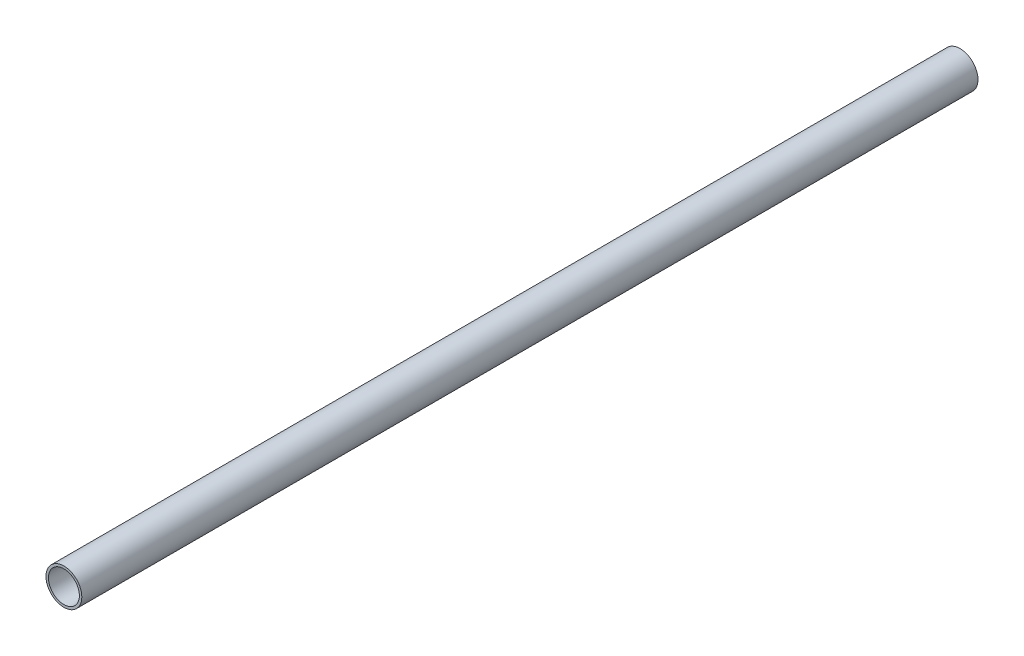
ISO-10303-21;
HEADER;
FILE_DESCRIPTION(('STEP AP214'),'2;1');
FILE_NAME('part.step','',(''),(''),'','','');
FILE_SCHEMA(('AUTOMOTIVE_DESIGN { 1 0 10303 214 1 1 1 1 }'));
ENDSEC;
DATA;
#1=APPLICATION_CONTEXT('core data for automotive mechanical design processes');
#2=APPLICATION_PROTOCOL_DEFINITION('international standard','automotive_design',2000,#1);
#3=PRODUCT_CONTEXT('',#1,'mechanical');
#4=PRODUCT('Part','Part','',(#3));
#5=PRODUCT_RELATED_PRODUCT_CATEGORY('part','',(#4));
#6=PRODUCT_DEFINITION_FORMATION('','',#4);
#7=PRODUCT_DEFINITION_CONTEXT('part definition',#1,'design');
#8=PRODUCT_DEFINITION('design','',#6,#7);
#9=PRODUCT_DEFINITION_SHAPE('','',#8);
#10=(LENGTH_UNIT() NAMED_UNIT(*) SI_UNIT(.MILLI.,.METRE.));
#11=(NAMED_UNIT(*) PLANE_ANGLE_UNIT() SI_UNIT($,.RADIAN.));
#12=(NAMED_UNIT(*) SI_UNIT($,.STERADIAN.) SOLID_ANGLE_UNIT());
#13=UNCERTAINTY_MEASURE_WITH_UNIT(LENGTH_MEASURE(1.E-05),#10,'distance_accuracy_value','');
#14=(GEOMETRIC_REPRESENTATION_CONTEXT(3) GLOBAL_UNCERTAINTY_ASSIGNED_CONTEXT((#13)) GLOBAL_UNIT_ASSIGNED_CONTEXT((#10,
#11,#12)) REPRESENTATION_CONTEXT('',''));
#15=CARTESIAN_POINT('',(0.,0.,0.));
#16=DIRECTION('',(0.,0.,1.));
#17=DIRECTION('',(1.,0.,0.));
#18=AXIS2_PLACEMENT_3D('',#15,#16,#17);
#19=CARTESIAN_POINT('',(0.,0.,550.));
#20=DIRECTION('',(0.,0.,1.));
#21=DIRECTION('',(1.,0.,0.));
#22=AXIS2_PLACEMENT_3D('',#19,#20,#21);
#23=PLANE('',#22);
#24=CARTESIAN_POINT('',(0.,0.,550.));
#25=DIRECTION('',(0.,0.,1.));
#26=DIRECTION('',(1.,0.,0.));
#27=AXIS2_PLACEMENT_3D('',#24,#25,#26);
#28=CIRCLE('',#27,11.);
#29=CARTESIAN_POINT('',(11.,0.,550.));
#30=VERTEX_POINT('',#29);
#31=EDGE_CURVE('E10',#30,#30,#28,.T.);
#32=ORIENTED_EDGE('',*,*,#31,.T.);
#33=EDGE_LOOP('',(#32));
#34=FACE_BOUND('',#33,.T.);
#35=CARTESIAN_POINT('',(0.,0.,550.));
#36=DIRECTION('',(0.,0.,1.));
#37=DIRECTION('',(1.,0.,0.));
#38=AXIS2_PLACEMENT_3D('',#35,#36,#37);
#39=CIRCLE('',#38,9.5);
#40=CARTESIAN_POINT('',(9.5,0.,550.));
#41=VERTEX_POINT('',#40);
#42=EDGE_CURVE('E40',#41,#41,#39,.T.);
#43=ORIENTED_EDGE('',*,*,#42,.F.);
#44=EDGE_LOOP('',(#43));
#45=FACE_BOUND('',#44,.T.);
#46=ADVANCED_FACE('F29',(#34,#45),#23,.T.);
#47=CARTESIAN_POINT('',(0.,0.,0.));
#48=DIRECTION('',(0.,0.,1.));
#49=DIRECTION('',(1.,0.,0.));
#50=AXIS2_PLACEMENT_3D('',#47,#48,#49);
#51=PLANE('',#50);
#52=CARTESIAN_POINT('',(0.,0.,0.));
#53=DIRECTION('',(0.,0.,1.));
#54=DIRECTION('',(1.,0.,0.));
#55=AXIS2_PLACEMENT_3D('',#52,#53,#54);
#56=CIRCLE('',#55,11.);
#57=CARTESIAN_POINT('',(11.,0.,0.));
#58=VERTEX_POINT('',#57);
#59=EDGE_CURVE('E33',#58,#58,#56,.T.);
#60=ORIENTED_EDGE('',*,*,#59,.F.);
#61=EDGE_LOOP('',(#60));
#62=FACE_BOUND('',#61,.T.);
#63=CARTESIAN_POINT('',(0.,0.,0.));
#64=DIRECTION('',(0.,0.,1.));
#65=DIRECTION('',(1.,0.,0.));
#66=AXIS2_PLACEMENT_3D('',#63,#64,#65);
#67=CIRCLE('',#66,9.5);
#68=CARTESIAN_POINT('',(9.5,0.,0.));
#69=VERTEX_POINT('',#68);
#70=EDGE_CURVE('E42',#69,#69,#67,.T.);
#71=ORIENTED_EDGE('',*,*,#70,.T.);
#72=EDGE_LOOP('',(#71));
#73=FACE_BOUND('',#72,.T.);
#74=ADVANCED_FACE('F52',(#62,#73),#51,.F.);
#75=CARTESIAN_POINT('',(0.,0.,550.));
#76=DIRECTION('',(0.,0.,-1.));
#77=DIRECTION('',(-1.,0.,0.));
#78=AXIS2_PLACEMENT_3D('',#75,#76,#77);
#79=CYLINDRICAL_SURFACE('',#78,11.);
#80=ORIENTED_EDGE('',*,*,#31,.F.);
#81=EDGE_LOOP('',(#80));
#82=FACE_BOUND('',#81,.T.);
#83=ORIENTED_EDGE('',*,*,#59,.T.);
#84=EDGE_LOOP('',(#83));
#85=FACE_BOUND('',#84,.T.);
#86=ADVANCED_FACE('F31',(#82,#85),#79,.T.);
#87=CARTESIAN_POINT('',(0.,0.,550.));
#88=DIRECTION('',(0.,0.,-1.));
#89=DIRECTION('',(-1.,0.,0.));
#90=AXIS2_PLACEMENT_3D('',#87,#88,#89);
#91=CYLINDRICAL_SURFACE('',#90,9.5);
#92=ORIENTED_EDGE('',*,*,#42,.T.);
#93=EDGE_LOOP('',(#92));
#94=FACE_BOUND('',#93,.T.);
#95=ORIENTED_EDGE('',*,*,#70,.F.);
#96=EDGE_LOOP('',(#95));
#97=FACE_BOUND('',#96,.T.);
#98=ADVANCED_FACE('F48',(#94,#97),#91,.F.);
#99=CLOSED_SHELL('',(#46,#74,#86,#98));
#100=MANIFOLD_SOLID_BREP('B2',#99);
#101=ADVANCED_BREP_SHAPE_REPRESENTATION('',(#18,#100),#14);
#102=SHAPE_DEFINITION_REPRESENTATION(#9,#101);
ENDSEC;
END-ISO-10303-21;
